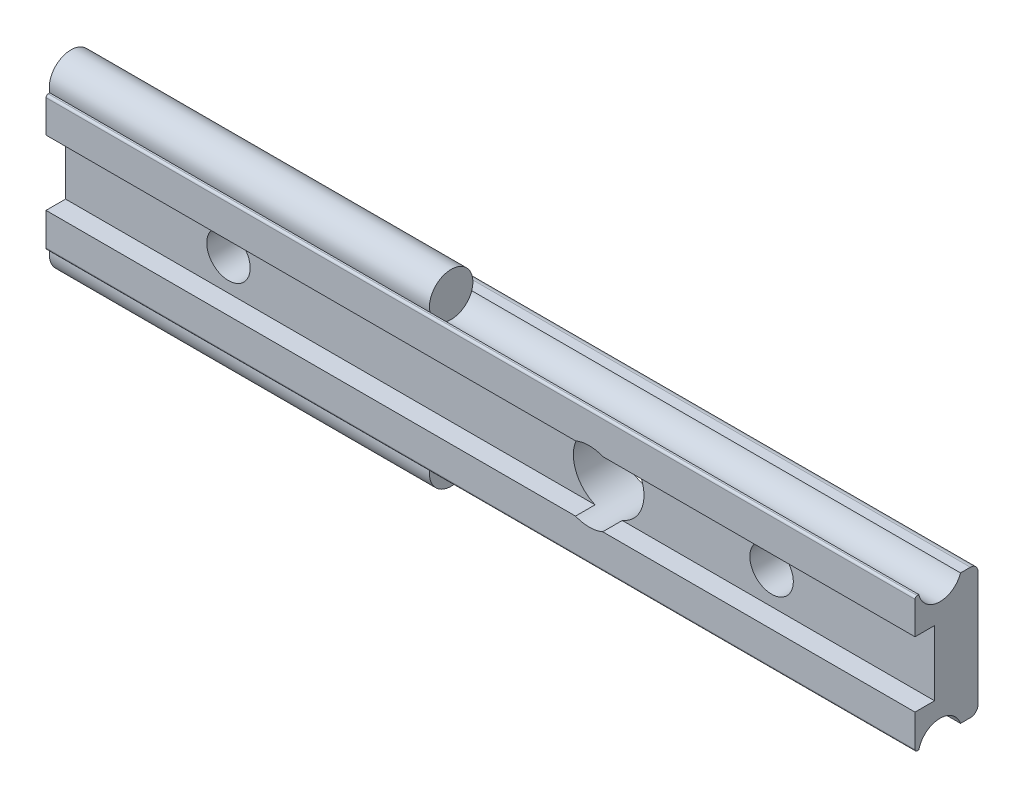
ISO-10303-21;
HEADER;
FILE_DESCRIPTION(('STEP AP214'),'2;1');
FILE_NAME('part.step','',(''),(''),'','','');
FILE_SCHEMA(('AUTOMOTIVE_DESIGN { 1 0 10303 214 1 1 1 1 }'));
ENDSEC;
DATA;
#1=APPLICATION_CONTEXT('core data for automotive mechanical design processes');
#2=APPLICATION_PROTOCOL_DEFINITION('international standard','automotive_design',2000,#1);
#3=PRODUCT_CONTEXT('',#1,'mechanical');
#4=PRODUCT('Part','Part','',(#3));
#5=PRODUCT_RELATED_PRODUCT_CATEGORY('part','',(#4));
#6=PRODUCT_DEFINITION_FORMATION('','',#4);
#7=PRODUCT_DEFINITION_CONTEXT('part definition',#1,'design');
#8=PRODUCT_DEFINITION('design','',#6,#7);
#9=PRODUCT_DEFINITION_SHAPE('','',#8);
#10=(LENGTH_UNIT() NAMED_UNIT(*) SI_UNIT(.MILLI.,.METRE.));
#11=(NAMED_UNIT(*) PLANE_ANGLE_UNIT() SI_UNIT($,.RADIAN.));
#12=(NAMED_UNIT(*) SI_UNIT($,.STERADIAN.) SOLID_ANGLE_UNIT());
#13=UNCERTAINTY_MEASURE_WITH_UNIT(LENGTH_MEASURE(1.E-05),#10,'distance_accuracy_value','');
#14=(GEOMETRIC_REPRESENTATION_CONTEXT(3) GLOBAL_UNCERTAINTY_ASSIGNED_CONTEXT((#13)) GLOBAL_UNIT_ASSIGNED_CONTEXT((#10,
#11,#12)) REPRESENTATION_CONTEXT('',''));
#15=CARTESIAN_POINT('',(0.,0.,0.));
#16=DIRECTION('',(0.,0.,1.));
#17=DIRECTION('',(1.,0.,0.));
#18=AXIS2_PLACEMENT_3D('',#15,#16,#17);
#19=CARTESIAN_POINT('',(-15.,-6.65000008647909,3.5000001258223));
#20=DIRECTION('',(1.,0.,0.));
#21=DIRECTION('',(0.,0.,-1.));
#22=AXIS2_PLACEMENT_3D('',#19,#20,#21);
#23=CYLINDRICAL_SURFACE('',#22,2.00000010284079);
#24=DIRECTION('',(1.,0.,0.));
#25=VECTOR('',#24,1.);
#26=CARTESIAN_POINT('',(-15.,-6.19000011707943,5.4463814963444));
#27=LINE('',#26,#25);
#28=CARTESIAN_POINT('',(20.,-6.19000011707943,5.4463814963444));
#29=VERTEX_POINT('',#28);
#30=CARTESIAN_POINT('',(65.,-6.19000011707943,5.4463814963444));
#31=VERTEX_POINT('',#30);
#32=EDGE_CURVE('E36',#29,#31,#27,.T.);
#33=ORIENTED_EDGE('',*,*,#32,.F.);
#34=CARTESIAN_POINT('',(20.,-6.65000008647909,3.5000001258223));
#35=DIRECTION('',(-1.,0.,0.));
#36=DIRECTION('',(0.,0.,1.));
#37=AXIS2_PLACEMENT_3D('',#34,#35,#36);
#38=CIRCLE('',#37,2.00000010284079);
#39=CARTESIAN_POINT('',(20.,-6.00000004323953,1.60857199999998));
#40=VERTEX_POINT('',#39);
#41=EDGE_CURVE('E31',#29,#40,#38,.T.);
#42=ORIENTED_EDGE('',*,*,#41,.T.);
#43=DIRECTION('',(1.,0.,0.));
#44=VECTOR('',#43,1.);
#45=CARTESIAN_POINT('',(-15.,-6.00000004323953,1.60857199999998));
#46=LINE('',#45,#44);
#47=CARTESIAN_POINT('',(65.,-6.00000004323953,1.60857199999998));
#48=VERTEX_POINT('',#47);
#49=EDGE_CURVE('E181',#40,#48,#46,.T.);
#50=ORIENTED_EDGE('',*,*,#49,.T.);
#51=CARTESIAN_POINT('',(65.,-6.65000008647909,3.5000001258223));
#52=DIRECTION('',(-1.,0.,0.));
#53=DIRECTION('',(0.,0.,1.));
#54=AXIS2_PLACEMENT_3D('',#51,#52,#53);
#55=CIRCLE('',#54,2.00000010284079);
#56=EDGE_CURVE('E257',#31,#48,#55,.T.);
#57=ORIENTED_EDGE('',*,*,#56,.F.);
#58=EDGE_LOOP('',(#33,#42,#50,#57));
#59=FACE_BOUND('',#58,.T.);
#60=ADVANCED_FACE('F14',(#59),#23,.F.);
#61=CARTESIAN_POINT('',(-15.,6.65000008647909,3.5000001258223));
#62=DIRECTION('',(1.,0.,0.));
#63=DIRECTION('',(0.,0.,-1.));
#64=AXIS2_PLACEMENT_3D('',#61,#62,#63);
#65=CYLINDRICAL_SURFACE('',#64,2.00000010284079);
#66=DIRECTION('',(1.,0.,0.));
#67=VECTOR('',#66,1.);
#68=CARTESIAN_POINT('',(-15.,6.00000004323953,1.60857199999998));
#69=LINE('',#68,#67);
#70=CARTESIAN_POINT('',(20.,6.00000004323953,1.60857199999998));
#71=VERTEX_POINT('',#70);
#72=CARTESIAN_POINT('',(65.,6.00000004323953,1.60857199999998));
#73=VERTEX_POINT('',#72);
#74=EDGE_CURVE('E337',#71,#73,#69,.T.);
#75=ORIENTED_EDGE('',*,*,#74,.F.);
#76=CARTESIAN_POINT('',(20.,6.65000008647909,3.5000001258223));
#77=DIRECTION('',(-1.,0.,0.));
#78=DIRECTION('',(0.,0.,1.));
#79=AXIS2_PLACEMENT_3D('',#76,#77,#78);
#80=CIRCLE('',#79,2.00000010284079);
#81=CARTESIAN_POINT('',(20.,6.19000011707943,5.4463814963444));
#82=VERTEX_POINT('',#81);
#83=EDGE_CURVE('E197',#71,#82,#80,.T.);
#84=ORIENTED_EDGE('',*,*,#83,.T.);
#85=DIRECTION('',(1.,0.,0.));
#86=VECTOR('',#85,1.);
#87=CARTESIAN_POINT('',(-15.,6.19000011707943,5.4463814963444));
#88=LINE('',#87,#86);
#89=CARTESIAN_POINT('',(65.,6.19000011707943,5.4463814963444));
#90=VERTEX_POINT('',#89);
#91=EDGE_CURVE('E334',#82,#90,#88,.T.);
#92=ORIENTED_EDGE('',*,*,#91,.T.);
#93=CARTESIAN_POINT('',(65.,6.65000008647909,3.5000001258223));
#94=DIRECTION('',(-1.,0.,0.));
#95=DIRECTION('',(0.,0.,-1.));
#96=AXIS2_PLACEMENT_3D('',#93,#94,#95);
#97=CIRCLE('',#96,2.00000010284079);
#98=EDGE_CURVE('E227',#73,#90,#97,.T.);
#99=ORIENTED_EDGE('',*,*,#98,.F.);
#100=EDGE_LOOP('',(#75,#84,#92,#99));
#101=FACE_BOUND('',#100,.T.);
#102=ADVANCED_FACE('F347',(#101),#65,.F.);
#103=CARTESIAN_POINT('',(-15.,-3.00000011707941,5.79999999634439));
#104=DIRECTION('',(0.,1.,0.));
#105=DIRECTION('',(0.,0.,1.));
#106=AXIS2_PLACEMENT_3D('',#103,#104,#105);
#107=PLANE('',#106);
#108=DIRECTION('',(0.,0.,-1.));
#109=VECTOR('',#108,1.);
#110=CARTESIAN_POINT('',(36.2499997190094,-3.00000011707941,5.7999999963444));
#111=LINE('',#110,#109);
#112=CARTESIAN_POINT('',(36.2499997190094,-3.00000011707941,5.7999999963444));
#113=VERTEX_POINT('',#112);
#114=CARTESIAN_POINT('',(36.2499997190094,-3.00000011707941,3.99999999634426));
#115=VERTEX_POINT('',#114);
#116=EDGE_CURVE('E214',#113,#115,#111,.T.);
#117=ORIENTED_EDGE('',*,*,#116,.F.);
#118=DIRECTION('',(1.,0.,0.));
#119=VECTOR('',#118,1.);
#120=CARTESIAN_POINT('',(-15.,-3.00000011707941,5.79999999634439));
#121=LINE('',#120,#119);
#122=CARTESIAN_POINT('',(65.,-3.00000011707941,5.79999999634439));
#123=VERTEX_POINT('',#122);
#124=EDGE_CURVE('E314',#113,#123,#121,.T.);
#125=ORIENTED_EDGE('',*,*,#124,.T.);
#126=DIRECTION('',(0.,0.,1.));
#127=VECTOR('',#126,1.);
#128=CARTESIAN_POINT('',(65.,-3.00000011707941,5.79999999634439));
#129=LINE('',#128,#127);
#130=CARTESIAN_POINT('',(65.,-3.00000011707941,3.99999999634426));
#131=VERTEX_POINT('',#130);
#132=EDGE_CURVE('E245',#131,#123,#129,.T.);
#133=ORIENTED_EDGE('',*,*,#132,.F.);
#134=DIRECTION('',(1.,0.,0.));
#135=VECTOR('',#134,1.);
#136=CARTESIAN_POINT('',(-15.,-3.00000011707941,3.99999999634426));
#137=LINE('',#136,#135);
#138=EDGE_CURVE('E318',#115,#131,#137,.T.);
#139=ORIENTED_EDGE('',*,*,#138,.F.);
#140=EDGE_LOOP('',(#117,#125,#133,#139));
#141=FACE_BOUND('',#140,.T.);
#142=ADVANCED_FACE('F366',(#141),#107,.T.);
#143=CARTESIAN_POINT('',(-15.,-3.00000011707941,3.99999999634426));
#144=DIRECTION('',(0.,0.,1.));
#145=DIRECTION('',(0.,-1.,0.));
#146=AXIS2_PLACEMENT_3D('',#143,#144,#145);
#147=PLANE('',#146);
#148=CARTESIAN_POINT('',(50.,0.,3.99999999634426));
#149=DIRECTION('',(0.,0.,1.));
#150=DIRECTION('',(1.,0.,0.));
#151=AXIS2_PLACEMENT_3D('',#148,#149,#150);
#152=CIRCLE('',#151,2.);
#153=CARTESIAN_POINT('',(52.,0.,3.99999999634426));
#154=VERTEX_POINT('',#153);
#155=EDGE_CURVE('E571',#154,#154,#152,.T.);
#156=ORIENTED_EDGE('',*,*,#155,.F.);
#157=EDGE_LOOP('',(#156));
#158=FACE_BOUND('',#157,.T.);
#159=CARTESIAN_POINT('',(35.,0.,3.99999999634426));
#160=DIRECTION('',(0.,0.,1.));
#161=DIRECTION('',(0.,-1.,0.));
#162=AXIS2_PLACEMENT_3D('',#159,#160,#161);
#163=CIRCLE('',#162,3.25);
#164=CARTESIAN_POINT('',(36.2499997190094,3.00000011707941,3.99999999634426));
#165=VERTEX_POINT('',#164);
#166=EDGE_CURVE('E212',#115,#165,#163,.T.);
#167=ORIENTED_EDGE('',*,*,#166,.F.);
#168=ORIENTED_EDGE('',*,*,#138,.T.);
#169=DIRECTION('',(0.,-1.,0.));
#170=VECTOR('',#169,1.);
#171=CARTESIAN_POINT('',(65.,-3.00000011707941,3.99999999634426));
#172=LINE('',#171,#170);
#173=CARTESIAN_POINT('',(65.,3.00000011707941,3.99999999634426));
#174=VERTEX_POINT('',#173);
#175=EDGE_CURVE('E242',#174,#131,#172,.T.);
#176=ORIENTED_EDGE('',*,*,#175,.F.);
#177=DIRECTION('',(1.,0.,0.));
#178=VECTOR('',#177,1.);
#179=CARTESIAN_POINT('',(-15.,3.00000011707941,3.99999999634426));
#180=LINE('',#179,#178);
#181=EDGE_CURVE('E322',#165,#174,#180,.T.);
#182=ORIENTED_EDGE('',*,*,#181,.F.);
#183=EDGE_LOOP('',(#167,#168,#176,#182));
#184=FACE_BOUND('',#183,.T.);
#185=ADVANCED_FACE('F392',(#158,#184),#147,.T.);
#186=CARTESIAN_POINT('',(-15.,3.00000011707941,5.7999999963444));
#187=DIRECTION('',(0.,-1.,0.));
#188=DIRECTION('',(0.,0.,-1.));
#189=AXIS2_PLACEMENT_3D('',#186,#187,#188);
#190=PLANE('',#189);
#191=DIRECTION('',(0.,0.,-1.));
#192=VECTOR('',#191,1.);
#193=CARTESIAN_POINT('',(33.7500002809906,3.00000011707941,5.7999999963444));
#194=LINE('',#193,#192);
#195=CARTESIAN_POINT('',(33.7500002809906,3.00000011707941,5.7999999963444));
#196=VERTEX_POINT('',#195);
#197=CARTESIAN_POINT('',(33.7500002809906,3.00000011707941,3.99999999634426));
#198=VERTEX_POINT('',#197);
#199=EDGE_CURVE('E217',#196,#198,#194,.T.);
#200=ORIENTED_EDGE('',*,*,#199,.F.);
#201=DIRECTION('',(1.,0.,0.));
#202=VECTOR('',#201,1.);
#203=CARTESIAN_POINT('',(-15.,3.00000011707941,5.7999999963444));
#204=LINE('',#203,#202);
#205=CARTESIAN_POINT('',(-15.,3.00000011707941,5.7999999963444));
#206=VERTEX_POINT('',#205);
#207=EDGE_CURVE('E323',#206,#196,#204,.T.);
#208=ORIENTED_EDGE('',*,*,#207,.F.);
#209=DIRECTION('',(0.,0.,-1.));
#210=VECTOR('',#209,1.);
#211=CARTESIAN_POINT('',(-15.,3.00000011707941,5.7999999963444));
#212=LINE('',#211,#210);
#213=CARTESIAN_POINT('',(-15.,3.00000011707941,3.99999999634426));
#214=VERTEX_POINT('',#213);
#215=EDGE_CURVE('E283',#206,#214,#212,.T.);
#216=ORIENTED_EDGE('',*,*,#215,.T.);
#217=EDGE_CURVE('E319',#214,#198,#180,.T.);
#218=ORIENTED_EDGE('',*,*,#217,.T.);
#219=EDGE_LOOP('',(#200,#208,#216,#218));
#220=FACE_BOUND('',#219,.T.);
#221=ADVANCED_FACE('F397',(#220),#190,.T.);
#222=CARTESIAN_POINT('',(-15.,5.30000004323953,0.7));
#223=DIRECTION('',(1.,0.,0.));
#224=DIRECTION('',(0.,0.,-1.));
#225=AXIS2_PLACEMENT_3D('',#222,#223,#224);
#226=CYLINDRICAL_SURFACE('',#225,0.7);
#227=CARTESIAN_POINT('',(65.,5.30000004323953,0.7));
#228=DIRECTION('',(1.,0.,0.));
#229=DIRECTION('',(0.,0.,-1.));
#230=AXIS2_PLACEMENT_3D('',#227,#228,#229);
#231=CIRCLE('',#230,0.7);
#232=CARTESIAN_POINT('',(65.,5.30000004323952,0.));
#233=VERTEX_POINT('',#232);
#234=CARTESIAN_POINT('',(65.,6.00000004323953,0.7));
#235=VERTEX_POINT('',#234);
#236=EDGE_CURVE('E221',#233,#235,#231,.T.);
#237=ORIENTED_EDGE('',*,*,#236,.F.);
#238=DIRECTION('',(1.,0.,0.));
#239=VECTOR('',#238,1.);
#240=CARTESIAN_POINT('',(-15.,5.30000004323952,0.));
#241=LINE('',#240,#239);
#242=CARTESIAN_POINT('',(-15.,5.30000004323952,0.));
#243=VERTEX_POINT('',#242);
#244=EDGE_CURVE('E9',#243,#233,#241,.T.);
#245=ORIENTED_EDGE('',*,*,#244,.F.);
#246=CARTESIAN_POINT('',(-15.,5.30000004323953,0.7));
#247=DIRECTION('',(1.,0.,0.));
#248=DIRECTION('',(0.,0.,-1.));
#249=AXIS2_PLACEMENT_3D('',#246,#247,#248);
#250=CIRCLE('',#249,0.7);
#251=CARTESIAN_POINT('',(-15.,6.00000004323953,0.7));
#252=VERTEX_POINT('',#251);
#253=EDGE_CURVE('E269',#243,#252,#250,.T.);
#254=ORIENTED_EDGE('',*,*,#253,.T.);
#255=DIRECTION('',(1.,0.,0.));
#256=VECTOR('',#255,1.);
#257=CARTESIAN_POINT('',(-15.,6.00000004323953,0.7));
#258=LINE('',#257,#256);
#259=EDGE_CURVE('E302',#252,#235,#258,.T.);
#260=ORIENTED_EDGE('',*,*,#259,.T.);
#261=EDGE_LOOP('',(#237,#245,#254,#260));
#262=FACE_BOUND('',#261,.T.);
#263=ADVANCED_FACE('F16',(#262),#226,.T.);
#264=CARTESIAN_POINT('',(-15.,-5.30000004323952,0.));
#265=DIRECTION('',(0.,0.,-1.));
#266=DIRECTION('',(-1.,0.,0.));
#267=AXIS2_PLACEMENT_3D('',#264,#265,#266);
#268=PLANE('',#267);
#269=CARTESIAN_POINT('',(0.,0.,0.));
#270=DIRECTION('',(0.,0.,-1.));
#271=DIRECTION('',(-1.,0.,0.));
#272=AXIS2_PLACEMENT_3D('',#269,#270,#271);
#273=CIRCLE('',#272,2.);
#274=CARTESIAN_POINT('',(-2.,0.,0.));
#275=VERTEX_POINT('',#274);
#276=EDGE_CURVE('E194',#275,#275,#273,.T.);
#277=ORIENTED_EDGE('',*,*,#276,.F.);
#278=EDGE_LOOP('',(#277));
#279=FACE_BOUND('',#278,.T.);
#280=CARTESIAN_POINT('',(50.,0.,0.));
#281=DIRECTION('',(0.,0.,-1.));
#282=DIRECTION('',(-1.,0.,0.));
#283=AXIS2_PLACEMENT_3D('',#280,#281,#282);
#284=CIRCLE('',#283,2.);
#285=CARTESIAN_POINT('',(48.,0.,0.));
#286=VERTEX_POINT('',#285);
#287=EDGE_CURVE('E18',#286,#286,#284,.T.);
#288=ORIENTED_EDGE('',*,*,#287,.F.);
#289=EDGE_LOOP('',(#288));
#290=FACE_BOUND('',#289,.T.);
#291=CARTESIAN_POINT('',(35.,0.,0.));
#292=DIRECTION('',(0.,0.,-1.));
#293=DIRECTION('',(-1.,0.,0.));
#294=AXIS2_PLACEMENT_3D('',#291,#292,#293);
#295=CIRCLE('',#294,3.25);
#296=CARTESIAN_POINT('',(31.75,0.,0.));
#297=VERTEX_POINT('',#296);
#298=EDGE_CURVE('E199',#297,#297,#295,.T.);
#299=ORIENTED_EDGE('',*,*,#298,.F.);
#300=EDGE_LOOP('',(#299));
#301=FACE_BOUND('',#300,.T.);
#302=DIRECTION('',(0.,1.,0.));
#303=VECTOR('',#302,1.);
#304=CARTESIAN_POINT('',(65.,-5.30000004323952,0.));
#305=LINE('',#304,#303);
#306=CARTESIAN_POINT('',(65.,-5.30000004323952,0.));
#307=VERTEX_POINT('',#306);
#308=EDGE_CURVE('E266',#307,#233,#305,.T.);
#309=ORIENTED_EDGE('',*,*,#308,.F.);
#310=DIRECTION('',(1.,0.,0.));
#311=VECTOR('',#310,1.);
#312=CARTESIAN_POINT('',(-15.,-5.30000004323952,0.));
#313=LINE('',#312,#311);
#314=CARTESIAN_POINT('',(-15.,-5.30000004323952,0.));
#315=VERTEX_POINT('',#314);
#316=EDGE_CURVE('E23',#315,#307,#313,.T.);
#317=ORIENTED_EDGE('',*,*,#316,.F.);
#318=DIRECTION('',(0.,1.,0.));
#319=VECTOR('',#318,1.);
#320=CARTESIAN_POINT('',(-15.,-5.30000004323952,0.));
#321=LINE('',#320,#319);
#322=EDGE_CURVE('E300',#315,#243,#321,.T.);
#323=ORIENTED_EDGE('',*,*,#322,.T.);
#324=ORIENTED_EDGE('',*,*,#244,.T.);
#325=EDGE_LOOP('',(#309,#317,#323,#324));
#326=FACE_BOUND('',#325,.T.);
#327=ADVANCED_FACE('F355',(#279,#290,#301,#326),#268,.T.);
#328=CARTESIAN_POINT('',(-15.,-5.30000004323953,0.7));
#329=DIRECTION('',(1.,0.,0.));
#330=DIRECTION('',(0.,0.,-1.));
#331=AXIS2_PLACEMENT_3D('',#328,#329,#330);
#332=CYLINDRICAL_SURFACE('',#331,0.7);
#333=CARTESIAN_POINT('',(65.,-5.30000004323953,0.7));
#334=DIRECTION('',(1.,0.,0.));
#335=DIRECTION('',(0.,0.,1.));
#336=AXIS2_PLACEMENT_3D('',#333,#334,#335);
#337=CIRCLE('',#336,0.7);
#338=CARTESIAN_POINT('',(65.,-6.00000004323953,0.7));
#339=VERTEX_POINT('',#338);
#340=EDGE_CURVE('E263',#339,#307,#337,.T.);
#341=ORIENTED_EDGE('',*,*,#340,.F.);
#342=DIRECTION('',(1.,0.,0.));
#343=VECTOR('',#342,1.);
#344=CARTESIAN_POINT('',(-15.,-6.00000004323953,0.7));
#345=LINE('',#344,#343);
#346=CARTESIAN_POINT('',(-15.,-6.00000004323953,0.7));
#347=VERTEX_POINT('',#346);
#348=EDGE_CURVE('E185',#347,#339,#345,.T.);
#349=ORIENTED_EDGE('',*,*,#348,.F.);
#350=CARTESIAN_POINT('',(-15.,-5.30000004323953,0.7));
#351=DIRECTION('',(1.,0.,0.));
#352=DIRECTION('',(0.,0.,1.));
#353=AXIS2_PLACEMENT_3D('',#350,#351,#352);
#354=CIRCLE('',#353,0.7);
#355=EDGE_CURVE('E173',#347,#315,#354,.T.);
#356=ORIENTED_EDGE('',*,*,#355,.T.);
#357=ORIENTED_EDGE('',*,*,#316,.T.);
#358=EDGE_LOOP('',(#341,#349,#356,#357));
#359=FACE_BOUND('',#358,.T.);
#360=ADVANCED_FACE('F358',(#359),#332,.T.);
#361=CARTESIAN_POINT('',(-15.,-6.00000004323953,1.60857199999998));
#362=DIRECTION('',(0.,-1.,0.));
#363=DIRECTION('',(-1.,0.,0.));
#364=AXIS2_PLACEMENT_3D('',#361,#362,#363);
#365=PLANE('',#364);
#366=DIRECTION('',(0.,0.,-1.));
#367=VECTOR('',#366,1.);
#368=CARTESIAN_POINT('',(65.,-6.00000004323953,1.60857199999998));
#369=LINE('',#368,#367);
#370=EDGE_CURVE('E260',#48,#339,#369,.T.);
#371=ORIENTED_EDGE('',*,*,#370,.F.);
#372=ORIENTED_EDGE('',*,*,#49,.F.);
#373=CARTESIAN_POINT('',(-15.,-6.00000004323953,1.60857199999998));
#374=VERTEX_POINT('',#373);
#375=EDGE_CURVE('E178',#374,#40,#46,.T.);
#376=ORIENTED_EDGE('',*,*,#375,.F.);
#377=DIRECTION('',(0.,0.,-1.));
#378=VECTOR('',#377,1.);
#379=CARTESIAN_POINT('',(-15.,-6.00000004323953,1.60857199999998));
#380=LINE('',#379,#378);
#381=EDGE_CURVE('E164',#374,#347,#380,.T.);
#382=ORIENTED_EDGE('',*,*,#381,.T.);
#383=ORIENTED_EDGE('',*,*,#348,.T.);
#384=EDGE_LOOP('',(#371,#372,#376,#382,#383));
#385=FACE_BOUND('',#384,.T.);
#386=ADVANCED_FACE('F180',(#385),#365,.T.);
#387=CARTESIAN_POINT('',(-15.,-6.19000011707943,5.4463814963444));
#388=DIRECTION('',(0.,-1.,0.));
#389=DIRECTION('',(-1.,0.,0.));
#390=AXIS2_PLACEMENT_3D('',#387,#388,#389);
#391=PLANE('',#390);
#392=DIRECTION('',(0.,0.,-1.));
#393=VECTOR('',#392,1.);
#394=CARTESIAN_POINT('',(65.,-6.19000011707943,5.4463814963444));
#395=LINE('',#394,#393);
#396=CARTESIAN_POINT('',(65.,-6.19000011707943,5.59999999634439));
#397=VERTEX_POINT('',#396);
#398=EDGE_CURVE('E254',#397,#31,#395,.T.);
#399=ORIENTED_EDGE('',*,*,#398,.F.);
#400=DIRECTION('',(1.,0.,0.));
#401=VECTOR('',#400,1.);
#402=CARTESIAN_POINT('',(-15.,-6.19000011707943,5.59999999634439));
#403=LINE('',#402,#401);
#404=CARTESIAN_POINT('',(-15.,-6.19000011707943,5.59999999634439));
#405=VERTEX_POINT('',#404);
#406=EDGE_CURVE('E307',#405,#397,#403,.T.);
#407=ORIENTED_EDGE('',*,*,#406,.F.);
#408=DIRECTION('',(0.,0.,-1.));
#409=VECTOR('',#408,1.);
#410=CARTESIAN_POINT('',(-15.,-6.19000011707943,5.4463814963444));
#411=LINE('',#410,#409);
#412=CARTESIAN_POINT('',(-15.,-6.19000011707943,5.4463814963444));
#413=VERTEX_POINT('',#412);
#414=EDGE_CURVE('E175',#405,#413,#411,.T.);
#415=ORIENTED_EDGE('',*,*,#414,.T.);
#416=EDGE_CURVE('E189',#413,#29,#27,.T.);
#417=ORIENTED_EDGE('',*,*,#416,.T.);
#418=ORIENTED_EDGE('',*,*,#32,.T.);
#419=EDGE_LOOP('',(#399,#407,#415,#417,#418));
#420=FACE_BOUND('',#419,.T.);
#421=ADVANCED_FACE('F371',(#420),#391,.T.);
#422=CARTESIAN_POINT('',(-15.,-5.99000011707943,5.59999999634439));
#423=DIRECTION('',(1.,0.,0.));
#424=DIRECTION('',(0.,0.,-1.));
#425=AXIS2_PLACEMENT_3D('',#422,#423,#424);
#426=CYLINDRICAL_SURFACE('',#425,0.2);
#427=CARTESIAN_POINT('',(65.,-5.99000011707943,5.59999999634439));
#428=DIRECTION('',(1.,0.,0.));
#429=DIRECTION('',(0.,0.,-1.));
#430=AXIS2_PLACEMENT_3D('',#427,#428,#429);
#431=CIRCLE('',#430,0.2);
#432=CARTESIAN_POINT('',(65.,-5.99000011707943,5.79999999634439));
#433=VERTEX_POINT('',#432);
#434=EDGE_CURVE('E251',#433,#397,#431,.T.);
#435=ORIENTED_EDGE('',*,*,#434,.F.);
#436=DIRECTION('',(1.,0.,0.));
#437=VECTOR('',#436,1.);
#438=CARTESIAN_POINT('',(-15.,-5.99000011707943,5.79999999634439));
#439=LINE('',#438,#437);
#440=CARTESIAN_POINT('',(-15.,-5.99000011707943,5.79999999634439));
#441=VERTEX_POINT('',#440);
#442=EDGE_CURVE('E309',#441,#433,#439,.T.);
#443=ORIENTED_EDGE('',*,*,#442,.F.);
#444=CARTESIAN_POINT('',(-15.,-5.99000011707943,5.59999999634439));
#445=DIRECTION('',(1.,0.,0.));
#446=DIRECTION('',(0.,0.,-1.));
#447=AXIS2_PLACEMENT_3D('',#444,#445,#446);
#448=CIRCLE('',#447,0.2);
#449=EDGE_CURVE('E295',#441,#405,#448,.T.);
#450=ORIENTED_EDGE('',*,*,#449,.T.);
#451=ORIENTED_EDGE('',*,*,#406,.T.);
#452=EDGE_LOOP('',(#435,#443,#450,#451));
#453=FACE_BOUND('',#452,.T.);
#454=ADVANCED_FACE('F374',(#453),#426,.T.);
#455=CARTESIAN_POINT('',(-15.,-3.00000011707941,5.79999999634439));
#456=DIRECTION('',(0.,0.,1.));
#457=DIRECTION('',(1.,0.,0.));
#458=AXIS2_PLACEMENT_3D('',#455,#456,#457);
#459=PLANE('',#458);
#460=CARTESIAN_POINT('',(35.,0.,5.7999999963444));
#461=DIRECTION('',(0.,0.,-1.));
#462=DIRECTION('',(-1.,0.,0.));
#463=AXIS2_PLACEMENT_3D('',#460,#461,#462);
#464=CIRCLE('',#463,3.25);
#465=CARTESIAN_POINT('',(33.7500002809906,-3.00000011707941,5.7999999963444));
#466=VERTEX_POINT('',#465);
#467=EDGE_CURVE('E206',#113,#466,#464,.T.);
#468=ORIENTED_EDGE('',*,*,#467,.T.);
#469=CARTESIAN_POINT('',(-15.,-3.00000011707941,5.79999999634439));
#470=VERTEX_POINT('',#469);
#471=EDGE_CURVE('E311',#470,#466,#121,.T.);
#472=ORIENTED_EDGE('',*,*,#471,.F.);
#473=DIRECTION('',(0.,-1.,0.));
#474=VECTOR('',#473,1.);
#475=CARTESIAN_POINT('',(-15.,-3.00000011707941,5.79999999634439));
#476=LINE('',#475,#474);
#477=EDGE_CURVE('E292',#470,#441,#476,.T.);
#478=ORIENTED_EDGE('',*,*,#477,.T.);
#479=ORIENTED_EDGE('',*,*,#442,.T.);
#480=DIRECTION('',(0.,-1.,0.));
#481=VECTOR('',#480,1.);
#482=CARTESIAN_POINT('',(65.,-3.00000011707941,5.79999999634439));
#483=LINE('',#482,#481);
#484=EDGE_CURVE('E248',#123,#433,#483,.T.);
#485=ORIENTED_EDGE('',*,*,#484,.F.);
#486=ORIENTED_EDGE('',*,*,#124,.F.);
#487=EDGE_LOOP('',(#468,#472,#478,#479,#485,#486));
#488=FACE_BOUND('',#487,.T.);
#489=ADVANCED_FACE('F378',(#488),#459,.T.);
#490=DIRECTION('',(0.,0.,-1.));
#491=VECTOR('',#490,1.);
#492=CARTESIAN_POINT('',(33.7500002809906,-3.00000011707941,5.7999999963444));
#493=LINE('',#492,#491);
#494=CARTESIAN_POINT('',(33.7500002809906,-3.00000011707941,3.99999999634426));
#495=VERTEX_POINT('',#494);
#496=EDGE_CURVE('E219',#495,#466,#493,.F.);
#497=ORIENTED_EDGE('',*,*,#496,.F.);
#498=CARTESIAN_POINT('',(-15.,-3.00000011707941,3.99999999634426));
#499=VERTEX_POINT('',#498);
#500=EDGE_CURVE('E315',#499,#495,#137,.T.);
#501=ORIENTED_EDGE('',*,*,#500,.F.);
#502=DIRECTION('',(0.,0.,1.));
#503=VECTOR('',#502,1.);
#504=CARTESIAN_POINT('',(-15.,-3.00000011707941,5.79999999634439));
#505=LINE('',#504,#503);
#506=EDGE_CURVE('E289',#499,#470,#505,.T.);
#507=ORIENTED_EDGE('',*,*,#506,.T.);
#508=ORIENTED_EDGE('',*,*,#471,.T.);
#509=EDGE_LOOP('',(#497,#501,#507,#508));
#510=FACE_BOUND('',#509,.T.);
#511=ADVANCED_FACE('F382',(#510),#107,.T.);
#512=CARTESIAN_POINT('',(0.,0.,3.99999999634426));
#513=DIRECTION('',(0.,0.,1.));
#514=DIRECTION('',(1.,0.,0.));
#515=AXIS2_PLACEMENT_3D('',#512,#513,#514);
#516=CIRCLE('',#515,2.);
#517=CARTESIAN_POINT('',(2.,0.,3.99999999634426));
#518=VERTEX_POINT('',#517);
#519=EDGE_CURVE('E573',#518,#518,#516,.T.);
#520=ORIENTED_EDGE('',*,*,#519,.F.);
#521=EDGE_LOOP('',(#520));
#522=FACE_BOUND('',#521,.T.);
#523=EDGE_CURVE('E215',#198,#495,#163,.T.);
#524=ORIENTED_EDGE('',*,*,#523,.F.);
#525=ORIENTED_EDGE('',*,*,#217,.F.);
#526=DIRECTION('',(0.,-1.,0.));
#527=VECTOR('',#526,1.);
#528=CARTESIAN_POINT('',(-15.,-3.00000011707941,3.99999999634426));
#529=LINE('',#528,#527);
#530=EDGE_CURVE('E286',#214,#499,#529,.T.);
#531=ORIENTED_EDGE('',*,*,#530,.T.);
#532=ORIENTED_EDGE('',*,*,#500,.T.);
#533=EDGE_LOOP('',(#524,#525,#531,#532));
#534=FACE_BOUND('',#533,.T.);
#535=ADVANCED_FACE('F386',(#522,#534),#147,.T.);
#536=DIRECTION('',(0.,0.,-1.));
#537=VECTOR('',#536,1.);
#538=CARTESIAN_POINT('',(36.2499997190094,3.00000011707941,5.7999999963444));
#539=LINE('',#538,#537);
#540=CARTESIAN_POINT('',(36.2499997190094,3.00000011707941,5.7999999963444));
#541=VERTEX_POINT('',#540);
#542=EDGE_CURVE('E210',#165,#541,#539,.F.);
#543=ORIENTED_EDGE('',*,*,#542,.F.);
#544=ORIENTED_EDGE('',*,*,#181,.T.);
#545=DIRECTION('',(0.,0.,-1.));
#546=VECTOR('',#545,1.);
#547=CARTESIAN_POINT('',(65.,3.00000011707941,5.7999999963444));
#548=LINE('',#547,#546);
#549=CARTESIAN_POINT('',(65.,3.00000011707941,5.7999999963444));
#550=VERTEX_POINT('',#549);
#551=EDGE_CURVE('E239',#550,#174,#548,.T.);
#552=ORIENTED_EDGE('',*,*,#551,.F.);
#553=EDGE_CURVE('E326',#541,#550,#204,.T.);
#554=ORIENTED_EDGE('',*,*,#553,.F.);
#555=EDGE_LOOP('',(#543,#544,#552,#554));
#556=FACE_BOUND('',#555,.T.);
#557=ADVANCED_FACE('F390',(#556),#190,.T.);
#558=CARTESIAN_POINT('',(-15.,3.00000011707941,5.7999999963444));
#559=DIRECTION('',(0.,0.,1.));
#560=DIRECTION('',(1.,0.,0.));
#561=AXIS2_PLACEMENT_3D('',#558,#559,#560);
#562=PLANE('',#561);
#563=EDGE_CURVE('E207',#196,#541,#464,.T.);
#564=ORIENTED_EDGE('',*,*,#563,.T.);
#565=ORIENTED_EDGE('',*,*,#553,.T.);
#566=DIRECTION('',(0.,-1.,0.));
#567=VECTOR('',#566,1.);
#568=CARTESIAN_POINT('',(65.,3.00000011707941,5.7999999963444));
#569=LINE('',#568,#567);
#570=CARTESIAN_POINT('',(65.,5.99000011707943,5.7999999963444));
#571=VERTEX_POINT('',#570);
#572=EDGE_CURVE('E236',#571,#550,#569,.T.);
#573=ORIENTED_EDGE('',*,*,#572,.F.);
#574=DIRECTION('',(1.,0.,0.));
#575=VECTOR('',#574,1.);
#576=CARTESIAN_POINT('',(-15.,5.99000011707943,5.7999999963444));
#577=LINE('',#576,#575);
#578=CARTESIAN_POINT('',(-15.,5.99000011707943,5.7999999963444));
#579=VERTEX_POINT('',#578);
#580=EDGE_CURVE('E327',#579,#571,#577,.T.);
#581=ORIENTED_EDGE('',*,*,#580,.F.);
#582=DIRECTION('',(0.,-1.,0.));
#583=VECTOR('',#582,1.);
#584=CARTESIAN_POINT('',(-15.,3.00000011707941,5.7999999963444));
#585=LINE('',#584,#583);
#586=EDGE_CURVE('E280',#579,#206,#585,.T.);
#587=ORIENTED_EDGE('',*,*,#586,.T.);
#588=ORIENTED_EDGE('',*,*,#207,.T.);
#589=EDGE_LOOP('',(#564,#565,#573,#581,#587,#588));
#590=FACE_BOUND('',#589,.T.);
#591=ADVANCED_FACE('F395',(#590),#562,.T.);
#592=CARTESIAN_POINT('',(-15.,5.99000011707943,5.5999999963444));
#593=DIRECTION('',(1.,0.,0.));
#594=DIRECTION('',(0.,0.,-1.));
#595=AXIS2_PLACEMENT_3D('',#592,#593,#594);
#596=CYLINDRICAL_SURFACE('',#595,0.2);
#597=CARTESIAN_POINT('',(65.,5.99000011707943,5.5999999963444));
#598=DIRECTION('',(1.,0.,0.));
#599=DIRECTION('',(0.,0.,1.));
#600=AXIS2_PLACEMENT_3D('',#597,#598,#599);
#601=CIRCLE('',#600,0.2);
#602=CARTESIAN_POINT('',(65.,6.19000011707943,5.5999999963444));
#603=VERTEX_POINT('',#602);
#604=EDGE_CURVE('E233',#603,#571,#601,.T.);
#605=ORIENTED_EDGE('',*,*,#604,.F.);
#606=DIRECTION('',(1.,0.,0.));
#607=VECTOR('',#606,1.);
#608=CARTESIAN_POINT('',(-15.,6.19000011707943,5.5999999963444));
#609=LINE('',#608,#607);
#610=CARTESIAN_POINT('',(-15.,6.19000011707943,5.5999999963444));
#611=VERTEX_POINT('',#610);
#612=EDGE_CURVE('E329',#611,#603,#609,.T.);
#613=ORIENTED_EDGE('',*,*,#612,.F.);
#614=CARTESIAN_POINT('',(-15.,5.99000011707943,5.5999999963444));
#615=DIRECTION('',(1.,0.,0.));
#616=DIRECTION('',(0.,0.,1.));
#617=AXIS2_PLACEMENT_3D('',#614,#615,#616);
#618=CIRCLE('',#617,0.2);
#619=EDGE_CURVE('E277',#611,#579,#618,.T.);
#620=ORIENTED_EDGE('',*,*,#619,.T.);
#621=ORIENTED_EDGE('',*,*,#580,.T.);
#622=EDGE_LOOP('',(#605,#613,#620,#621));
#623=FACE_BOUND('',#622,.T.);
#624=ADVANCED_FACE('F400',(#623),#596,.T.);
#625=CARTESIAN_POINT('',(-15.,6.19000011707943,5.4463814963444));
#626=DIRECTION('',(0.,1.,0.));
#627=DIRECTION('',(1.,0.,0.));
#628=AXIS2_PLACEMENT_3D('',#625,#626,#627);
#629=PLANE('',#628);
#630=DIRECTION('',(0.,0.,1.));
#631=VECTOR('',#630,1.);
#632=CARTESIAN_POINT('',(65.,6.19000011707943,5.4463814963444));
#633=LINE('',#632,#631);
#634=EDGE_CURVE('E230',#90,#603,#633,.T.);
#635=ORIENTED_EDGE('',*,*,#634,.F.);
#636=ORIENTED_EDGE('',*,*,#91,.F.);
#637=CARTESIAN_POINT('',(-15.,6.19000011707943,5.4463814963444));
#638=VERTEX_POINT('',#637);
#639=EDGE_CURVE('E331',#638,#82,#88,.T.);
#640=ORIENTED_EDGE('',*,*,#639,.F.);
#641=DIRECTION('',(0.,0.,1.));
#642=VECTOR('',#641,1.);
#643=CARTESIAN_POINT('',(-15.,6.19000011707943,5.4463814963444));
#644=LINE('',#643,#642);
#645=EDGE_CURVE('E274',#638,#611,#644,.T.);
#646=ORIENTED_EDGE('',*,*,#645,.T.);
#647=ORIENTED_EDGE('',*,*,#612,.T.);
#648=EDGE_LOOP('',(#635,#636,#640,#646,#647));
#649=FACE_BOUND('',#648,.T.);
#650=ADVANCED_FACE('F404',(#649),#629,.T.);
#651=CARTESIAN_POINT('',(-15.,6.00000004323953,1.60857199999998));
#652=DIRECTION('',(0.,1.,0.));
#653=DIRECTION('',(1.,0.,0.));
#654=AXIS2_PLACEMENT_3D('',#651,#652,#653);
#655=PLANE('',#654);
#656=DIRECTION('',(0.,0.,1.));
#657=VECTOR('',#656,1.);
#658=CARTESIAN_POINT('',(65.,6.00000004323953,1.60857199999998));
#659=LINE('',#658,#657);
#660=EDGE_CURVE('E224',#235,#73,#659,.T.);
#661=ORIENTED_EDGE('',*,*,#660,.F.);
#662=ORIENTED_EDGE('',*,*,#259,.F.);
#663=DIRECTION('',(0.,0.,1.));
#664=VECTOR('',#663,1.);
#665=CARTESIAN_POINT('',(-15.,6.00000004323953,1.60857199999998));
#666=LINE('',#665,#664);
#667=CARTESIAN_POINT('',(-15.,6.00000004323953,1.60857199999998));
#668=VERTEX_POINT('',#667);
#669=EDGE_CURVE('E272',#252,#668,#666,.T.);
#670=ORIENTED_EDGE('',*,*,#669,.T.);
#671=EDGE_CURVE('E335',#668,#71,#69,.T.);
#672=ORIENTED_EDGE('',*,*,#671,.T.);
#673=ORIENTED_EDGE('',*,*,#74,.T.);
#674=EDGE_LOOP('',(#661,#662,#670,#672,#673));
#675=FACE_BOUND('',#674,.T.);
#676=ADVANCED_FACE('F343',(#675),#655,.T.);
#677=CARTESIAN_POINT('',(-15.,5.30000004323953,0.7));
#678=DIRECTION('',(1.,0.,0.));
#679=DIRECTION('',(0.,0.,-1.));
#680=AXIS2_PLACEMENT_3D('',#677,#678,#679);
#681=PLANE('',#680);
#682=ORIENTED_EDGE('',*,*,#253,.F.);
#683=ORIENTED_EDGE('',*,*,#322,.F.);
#684=ORIENTED_EDGE('',*,*,#355,.F.);
#685=ORIENTED_EDGE('',*,*,#381,.F.);
#686=CARTESIAN_POINT('',(-15.,-6.65000008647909,3.5000001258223));
#687=DIRECTION('',(-1.,0.,0.));
#688=DIRECTION('',(0.,0.,1.));
#689=AXIS2_PLACEMENT_3D('',#686,#687,#688);
#690=CIRCLE('',#689,2.00000010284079);
#691=EDGE_CURVE('E170',#374,#413,#690,.T.);
#692=ORIENTED_EDGE('',*,*,#691,.T.);
#693=ORIENTED_EDGE('',*,*,#414,.F.);
#694=ORIENTED_EDGE('',*,*,#449,.F.);
#695=ORIENTED_EDGE('',*,*,#477,.F.);
#696=ORIENTED_EDGE('',*,*,#506,.F.);
#697=ORIENTED_EDGE('',*,*,#530,.F.);
#698=ORIENTED_EDGE('',*,*,#215,.F.);
#699=ORIENTED_EDGE('',*,*,#586,.F.);
#700=ORIENTED_EDGE('',*,*,#619,.F.);
#701=ORIENTED_EDGE('',*,*,#645,.F.);
#702=CARTESIAN_POINT('',(-15.,6.65000008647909,3.5000001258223));
#703=DIRECTION('',(-1.,0.,0.));
#704=DIRECTION('',(0.,0.,1.));
#705=AXIS2_PLACEMENT_3D('',#702,#703,#704);
#706=CIRCLE('',#705,2.00000010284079);
#707=EDGE_CURVE('E201',#638,#668,#706,.T.);
#708=ORIENTED_EDGE('',*,*,#707,.T.);
#709=ORIENTED_EDGE('',*,*,#669,.F.);
#710=EDGE_LOOP('',(#682,#683,#684,#685,#692,#693,#694,#695,#696,#697,#698,#699,#700,#701,#708,#709));
#711=FACE_BOUND('',#710,.T.);
#712=ADVANCED_FACE('F167',(#711),#681,.F.);
#713=CARTESIAN_POINT('',(65.,5.30000004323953,0.7));
#714=DIRECTION('',(1.,0.,0.));
#715=DIRECTION('',(0.,0.,-1.));
#716=AXIS2_PLACEMENT_3D('',#713,#714,#715);
#717=PLANE('',#716);
#718=ORIENTED_EDGE('',*,*,#236,.T.);
#719=ORIENTED_EDGE('',*,*,#660,.T.);
#720=ORIENTED_EDGE('',*,*,#98,.T.);
#721=ORIENTED_EDGE('',*,*,#634,.T.);
#722=ORIENTED_EDGE('',*,*,#604,.T.);
#723=ORIENTED_EDGE('',*,*,#572,.T.);
#724=ORIENTED_EDGE('',*,*,#551,.T.);
#725=ORIENTED_EDGE('',*,*,#175,.T.);
#726=ORIENTED_EDGE('',*,*,#132,.T.);
#727=ORIENTED_EDGE('',*,*,#484,.T.);
#728=ORIENTED_EDGE('',*,*,#434,.T.);
#729=ORIENTED_EDGE('',*,*,#398,.T.);
#730=ORIENTED_EDGE('',*,*,#56,.T.);
#731=ORIENTED_EDGE('',*,*,#370,.T.);
#732=ORIENTED_EDGE('',*,*,#340,.T.);
#733=ORIENTED_EDGE('',*,*,#308,.T.);
#734=EDGE_LOOP('',(#718,#719,#720,#721,#722,#723,#724,#725,#726,#727,#728,#729,#730,#731,#732,#733));
#735=FACE_BOUND('',#734,.T.);
#736=ADVANCED_FACE('F351',(#735),#717,.T.);
#737=CARTESIAN_POINT('',(35.,0.,5.7999999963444));
#738=DIRECTION('',(0.,0.,-1.));
#739=DIRECTION('',(-1.,0.,0.));
#740=AXIS2_PLACEMENT_3D('',#737,#738,#739);
#741=CYLINDRICAL_SURFACE('',#740,3.25);
#742=ORIENTED_EDGE('',*,*,#496,.T.);
#743=ORIENTED_EDGE('',*,*,#467,.F.);
#744=ORIENTED_EDGE('',*,*,#116,.T.);
#745=ORIENTED_EDGE('',*,*,#166,.T.);
#746=ORIENTED_EDGE('',*,*,#542,.T.);
#747=ORIENTED_EDGE('',*,*,#563,.F.);
#748=ORIENTED_EDGE('',*,*,#199,.T.);
#749=ORIENTED_EDGE('',*,*,#523,.T.);
#750=EDGE_LOOP('',(#742,#743,#744,#745,#746,#747,#748,#749));
#751=FACE_BOUND('',#750,.T.);
#752=ORIENTED_EDGE('',*,*,#298,.T.);
#753=EDGE_LOOP('',(#752));
#754=FACE_BOUND('',#753,.T.);
#755=ADVANCED_FACE('F416',(#751,#754),#741,.F.);
#756=CARTESIAN_POINT('',(20.,6.65000008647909,3.5000001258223));
#757=DIRECTION('',(-1.,0.,0.));
#758=DIRECTION('',(0.,0.,1.));
#759=AXIS2_PLACEMENT_3D('',#756,#757,#758);
#760=CYLINDRICAL_SURFACE('',#759,2.00000010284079);
#761=ORIENTED_EDGE('',*,*,#707,.F.);
#762=ORIENTED_EDGE('',*,*,#639,.T.);
#763=EDGE_CURVE('E200',#82,#71,#80,.T.);
#764=ORIENTED_EDGE('',*,*,#763,.T.);
#765=ORIENTED_EDGE('',*,*,#671,.F.);
#766=EDGE_LOOP('',(#761,#762,#764,#765));
#767=FACE_BOUND('',#766,.T.);
#768=ADVANCED_FACE('F503',(#767),#760,.T.);
#769=CARTESIAN_POINT('',(20.,6.65000008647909,3.5000001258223));
#770=DIRECTION('',(-1.,0.,0.));
#771=DIRECTION('',(0.,0.,1.));
#772=AXIS2_PLACEMENT_3D('',#769,#770,#771);
#773=PLANE('',#772);
#774=ORIENTED_EDGE('',*,*,#83,.F.);
#775=ORIENTED_EDGE('',*,*,#763,.F.);
#776=EDGE_LOOP('',(#774,#775));
#777=FACE_BOUND('',#776,.T.);
#778=ADVANCED_FACE('F513',(#777),#773,.F.);
#779=CARTESIAN_POINT('',(20.,-6.65000008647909,3.5000001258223));
#780=DIRECTION('',(-1.,0.,0.));
#781=DIRECTION('',(0.,0.,1.));
#782=AXIS2_PLACEMENT_3D('',#779,#780,#781);
#783=CYLINDRICAL_SURFACE('',#782,2.00000010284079);
#784=ORIENTED_EDGE('',*,*,#691,.F.);
#785=ORIENTED_EDGE('',*,*,#375,.T.);
#786=EDGE_CURVE('E190',#40,#29,#38,.T.);
#787=ORIENTED_EDGE('',*,*,#786,.T.);
#788=ORIENTED_EDGE('',*,*,#416,.F.);
#789=EDGE_LOOP('',(#784,#785,#787,#788));
#790=FACE_BOUND('',#789,.T.);
#791=ADVANCED_FACE('F188',(#790),#783,.T.);
#792=CARTESIAN_POINT('',(20.,-6.65000008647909,3.5000001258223));
#793=DIRECTION('',(-1.,0.,0.));
#794=DIRECTION('',(0.,0.,1.));
#795=AXIS2_PLACEMENT_3D('',#792,#793,#794);
#796=PLANE('',#795);
#797=ORIENTED_EDGE('',*,*,#41,.F.);
#798=ORIENTED_EDGE('',*,*,#786,.F.);
#799=EDGE_LOOP('',(#797,#798));
#800=FACE_BOUND('',#799,.T.);
#801=ADVANCED_FACE('F532',(#800),#796,.F.);
#802=CARTESIAN_POINT('',(0.,0.,-6.00000000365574));
#803=DIRECTION('',(0.,0.,1.));
#804=DIRECTION('',(1.,0.,0.));
#805=AXIS2_PLACEMENT_3D('',#802,#803,#804);
#806=CYLINDRICAL_SURFACE('',#805,2.);
#807=ORIENTED_EDGE('',*,*,#276,.T.);
#808=EDGE_LOOP('',(#807));
#809=FACE_BOUND('',#808,.T.);
#810=ORIENTED_EDGE('',*,*,#519,.T.);
#811=EDGE_LOOP('',(#810));
#812=FACE_BOUND('',#811,.T.);
#813=ADVANCED_FACE('F541',(#809,#812),#806,.F.);
#814=CARTESIAN_POINT('',(50.,0.,-6.00000000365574));
#815=DIRECTION('',(0.,0.,1.));
#816=DIRECTION('',(1.,0.,0.));
#817=AXIS2_PLACEMENT_3D('',#814,#815,#816);
#818=CYLINDRICAL_SURFACE('',#817,2.);
#819=ORIENTED_EDGE('',*,*,#287,.T.);
#820=EDGE_LOOP('',(#819));
#821=FACE_BOUND('',#820,.T.);
#822=ORIENTED_EDGE('',*,*,#155,.T.);
#823=EDGE_LOOP('',(#822));
#824=FACE_BOUND('',#823,.T.);
#825=ADVANCED_FACE('F552',(#821,#824),#818,.F.);
#826=CLOSED_SHELL('',(#60,#102,#142,#185,#221,#263,#327,#360,#386,#421,#454,#489,#511,#535,#557,
#591,#624,#650,#676,#712,#736,#755,#768,#778,#791,#801,#813,#825));
#827=MANIFOLD_SOLID_BREP('B1',#826);
#828=ADVANCED_BREP_SHAPE_REPRESENTATION('',(#18,#827),#14);
#829=SHAPE_DEFINITION_REPRESENTATION(#9,#828);
ENDSEC;
END-ISO-10303-21;
